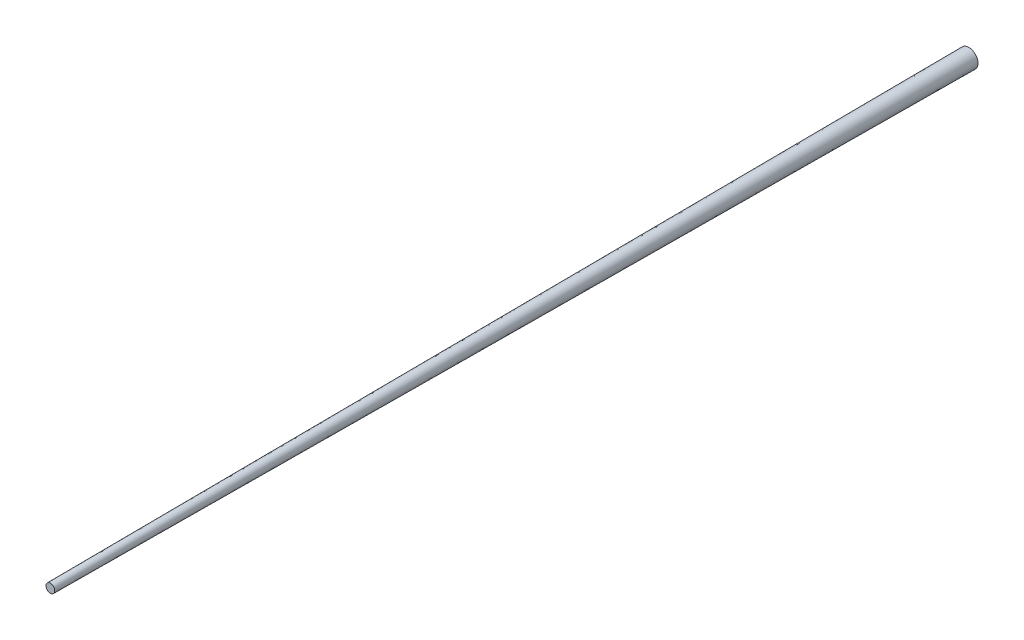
ISO-10303-21;
HEADER;
FILE_DESCRIPTION(('STEP AP214'),'2;1');
FILE_NAME('part.step','',(''),(''),'','','');
FILE_SCHEMA(('AUTOMOTIVE_DESIGN { 1 0 10303 214 1 1 1 1 }'));
ENDSEC;
DATA;
#1=APPLICATION_CONTEXT('core data for automotive mechanical design processes');
#2=APPLICATION_PROTOCOL_DEFINITION('international standard','automotive_design',2000,#1);
#3=PRODUCT_CONTEXT('',#1,'mechanical');
#4=PRODUCT('Part','Part','',(#3));
#5=PRODUCT_RELATED_PRODUCT_CATEGORY('part','',(#4));
#6=PRODUCT_DEFINITION_FORMATION('','',#4);
#7=PRODUCT_DEFINITION_CONTEXT('part definition',#1,'design');
#8=PRODUCT_DEFINITION('design','',#6,#7);
#9=PRODUCT_DEFINITION_SHAPE('','',#8);
#10=(LENGTH_UNIT() NAMED_UNIT(*) SI_UNIT(.MILLI.,.METRE.));
#11=(NAMED_UNIT(*) PLANE_ANGLE_UNIT() SI_UNIT($,.RADIAN.));
#12=(NAMED_UNIT(*) SI_UNIT($,.STERADIAN.) SOLID_ANGLE_UNIT());
#13=UNCERTAINTY_MEASURE_WITH_UNIT(LENGTH_MEASURE(1.E-05),#10,'distance_accuracy_value','');
#14=(GEOMETRIC_REPRESENTATION_CONTEXT(3) GLOBAL_UNCERTAINTY_ASSIGNED_CONTEXT((#13)) GLOBAL_UNIT_ASSIGNED_CONTEXT((#10,
#11,#12)) REPRESENTATION_CONTEXT('',''));
#15=CARTESIAN_POINT('',(0.,0.,0.));
#16=DIRECTION('',(0.,0.,1.));
#17=DIRECTION('',(1.,0.,0.));
#18=AXIS2_PLACEMENT_3D('',#15,#16,#17);
#19=CARTESIAN_POINT('',(0.,0.,0.));
#20=DIRECTION('',(0.,0.,-1.));
#21=DIRECTION('',(1.,0.,0.));
#22=AXIS2_PLACEMENT_3D('',#19,#20,#21);
#23=CONICAL_SURFACE('',#22,50.,0.005235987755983);
#24=CARTESIAN_POINT('',(0.,0.,5000.));
#25=DIRECTION('',(0.,0.,1.));
#26=DIRECTION('',(1.,0.,0.));
#27=AXIS2_PLACEMENT_3D('',#24,#25,#26);
#28=CIRCLE('',#27,23.8198219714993);
#29=CARTESIAN_POINT('',(23.8198219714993,0.,5000.));
#30=VERTEX_POINT('',#29);
#31=EDGE_CURVE('E10',#30,#30,#28,.T.);
#32=ORIENTED_EDGE('',*,*,#31,.F.);
#33=EDGE_LOOP('',(#32));
#34=FACE_BOUND('',#33,.T.);
#35=CARTESIAN_POINT('',(0.,0.,0.));
#36=DIRECTION('',(0.,0.,1.));
#37=DIRECTION('',(1.,0.,0.));
#38=AXIS2_PLACEMENT_3D('',#35,#36,#37);
#39=CIRCLE('',#38,50.);
#40=CARTESIAN_POINT('',(50.,0.,0.));
#41=VERTEX_POINT('',#40);
#42=EDGE_CURVE('E40',#41,#41,#39,.T.);
#43=ORIENTED_EDGE('',*,*,#42,.T.);
#44=EDGE_LOOP('',(#43));
#45=FACE_BOUND('',#44,.T.);
#46=ADVANCED_FACE('F34',(#34,#45),#23,.T.);
#47=CARTESIAN_POINT('',(0.,0.,5000.));
#48=DIRECTION('',(0.,0.,1.));
#49=DIRECTION('',(1.,0.,0.));
#50=AXIS2_PLACEMENT_3D('',#47,#48,#49);
#51=PLANE('',#50);
#52=ORIENTED_EDGE('',*,*,#31,.T.);
#53=EDGE_LOOP('',(#52));
#54=FACE_BOUND('',#53,.T.);
#55=ADVANCED_FACE('F51',(#54),#51,.T.);
#56=CARTESIAN_POINT('',(0.,0.,0.));
#57=DIRECTION('',(0.,0.,1.));
#58=DIRECTION('',(1.,0.,0.));
#59=AXIS2_PLACEMENT_3D('',#56,#57,#58);
#60=PLANE('',#59);
#61=ORIENTED_EDGE('',*,*,#42,.F.);
#62=EDGE_LOOP('',(#61));
#63=FACE_BOUND('',#62,.T.);
#64=ADVANCED_FACE('F49',(#63),#60,.F.);
#65=CLOSED_SHELL('',(#46,#55,#64));
#66=MANIFOLD_SOLID_BREP('B2',#65);
#67=ADVANCED_BREP_SHAPE_REPRESENTATION('',(#18,#66),#14);
#68=SHAPE_DEFINITION_REPRESENTATION(#9,#67);
ENDSEC;
END-ISO-10303-21;
